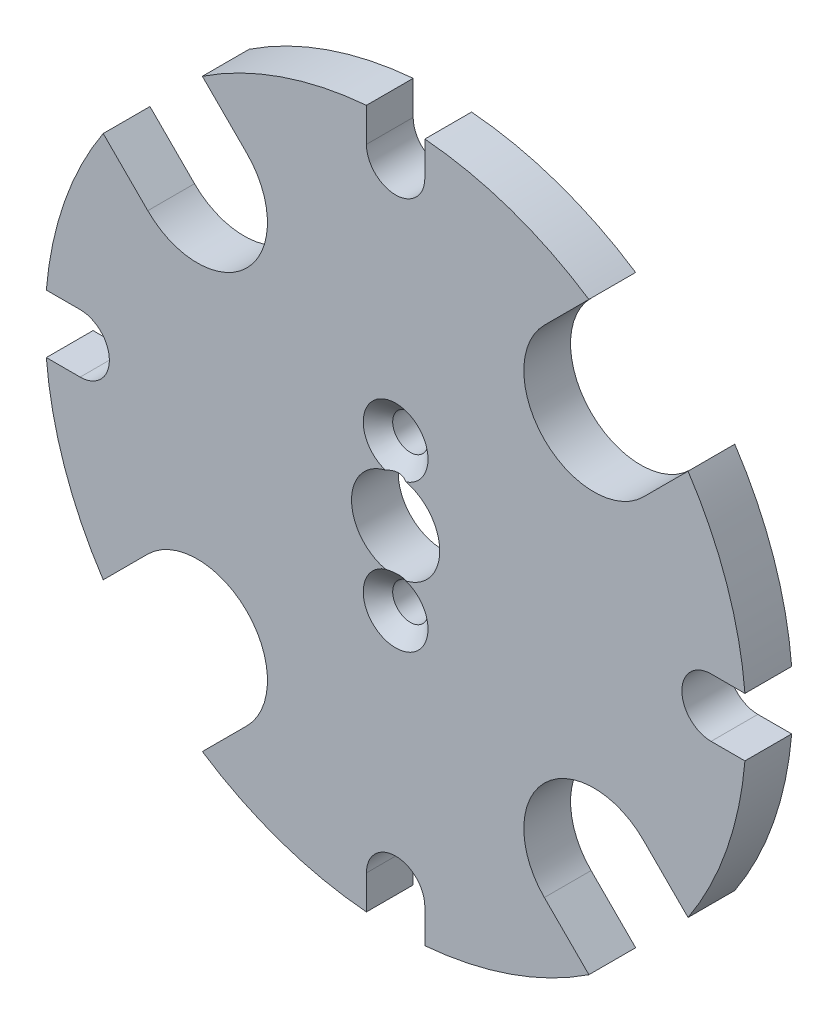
from build123d import *

# Parameters (mm, degrees)
SKETCH1_R                                       = 2.9972
BASE_EXTRUDE_DEPTH                              = 3.175
CUT_EXTRUDE3_DEPTH                              = 3.175
CSK_FOR_M2_FLAT_HEAD_MACHINE_SCREW1_D           = 2.4
CSK_FOR_M2_FLAT_HEAD_MACHINE_SCREW1_CSINK_D     = 4.4
CSK_FOR_M2_FLAT_HEAD_MACHINE_SCREW1_CSINK_ANGLE = 90


with BuildPart() as part:
    # Sketch1 → Base-Extrude (new body)
    with BuildSketch(Plane.XY):
        with BuildLine():
            Line((-1.98374, -21.43125), (-1.98374, -23.729726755))
            ThreePointArc((-1.98374, -23.729726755), (-16.837980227, -16.837980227), (-23.729726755, -1.98374))
            Line((-23.729726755, -1.98374), (-21.43125, -1.98374))
            ThreePointArc((-21.43125, -1.98374), (-19.44751, 0), (-21.43125, 1.98374))
            Line((-21.43125, 1.98374), (-23.729726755, 1.98374))
            ThreePointArc((-23.729726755, 1.98374), (-16.837980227, 16.837980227), (-1.98374, 23.729726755))
            Line((-1.98374, 23.729726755), (-1.98374, 21.43125))
            ThreePointArc((-1.98374, 21.43125), (0, 19.44751), (1.98374, 21.43125))
            Line((1.98374, 21.43125), (1.98374, 23.729726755))
            ThreePointArc((1.98374, 23.729726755), (16.837980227, 16.837980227), (23.729726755, 1.98374))
            Line((23.729726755, 1.98374), (21.43125, 1.98374))
            ThreePointArc((21.43125, 1.98374), (19.44751, 0), (21.43125, -1.98374))
            Line((21.43125, -1.98374), (23.729726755, -1.98374))
            ThreePointArc((23.729726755, -1.98374), (16.837980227, -16.837980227), (1.98374, -23.729726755))
            Line((1.98374, -23.729726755), (1.98374, -21.43125))
            ThreePointArc((1.98374, -21.43125), (0, -19.44751), (-1.98374, -21.43125))
        make_face()
        Circle(SKETCH1_R, mode=Mode.SUBTRACT)
    extrude(amount=BASE_EXTRUDE_DEPTH)

    # Sketch2 → Cut-Extrude3 (cut)
    with BuildSketch(Plane.XY):
        with BuildLine():
            Line((-10.102788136, -16.837980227), (-16.280941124, -23.016133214))
            Line((-16.280941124, -23.016133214), (-23.016133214, -16.280941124))
            Line((-23.016133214, -16.280941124), (-16.837980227, -10.102788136))
            ThreePointArc((-16.837980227, -10.102788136), (-10.102788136, -10.102788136), (-10.102788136, -16.837980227))
        make_face()
        with BuildLine():
            Line((-23.016133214, 16.280941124), (-16.280941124, 23.016133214))
            Line((-16.280941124, 23.016133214), (-10.102788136, 16.837980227))
            ThreePointArc((-10.102788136, 16.837980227), (-10.102788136, 10.102788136), (-16.837980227, 10.102788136))
            Line((-16.837980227, 10.102788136), (-23.016133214, 16.280941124))
        make_face()
        with BuildLine():
            Line((23.016133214, -16.280941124), (16.280941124, -23.016133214))
            Line((16.280941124, -23.016133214), (10.102788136, -16.837980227))
            ThreePointArc((10.102788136, -16.837980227), (10.102788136, -10.102788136), (16.837980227, -10.102788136))
            Line((16.837980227, -10.102788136), (23.016133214, -16.280941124))
        make_face()
        with BuildLine():
            Line((16.837980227, 10.102788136), (23.016133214, 16.280941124))
            Line((23.016133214, 16.280941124), (16.280941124, 23.016133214))
            Line((16.280941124, 23.016133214), (10.102788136, 16.837980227))
            ThreePointArc((10.102788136, 16.837980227), (10.102788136, 10.102788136), (16.837980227, 10.102788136))
        make_face()
    extrude(amount=CUT_EXTRUDE3_DEPTH, mode=Mode.SUBTRACT)

    # CSK for M2 Flat Head Machine Screw1 (through all)
    with Locations(Plane(origin=(0, 4.99872, 3.175), x_dir=(1, 0, 0), z_dir=(0, 0, 1))):
        with Locations((0, 0), (0, -9.99998)):
            CounterSinkHole(CSK_FOR_M2_FLAT_HEAD_MACHINE_SCREW1_D / 2, CSK_FOR_M2_FLAT_HEAD_MACHINE_SCREW1_CSINK_D / 2, counter_sink_angle=CSK_FOR_M2_FLAT_HEAD_MACHINE_SCREW1_CSINK_ANGLE)


solid = part.part
